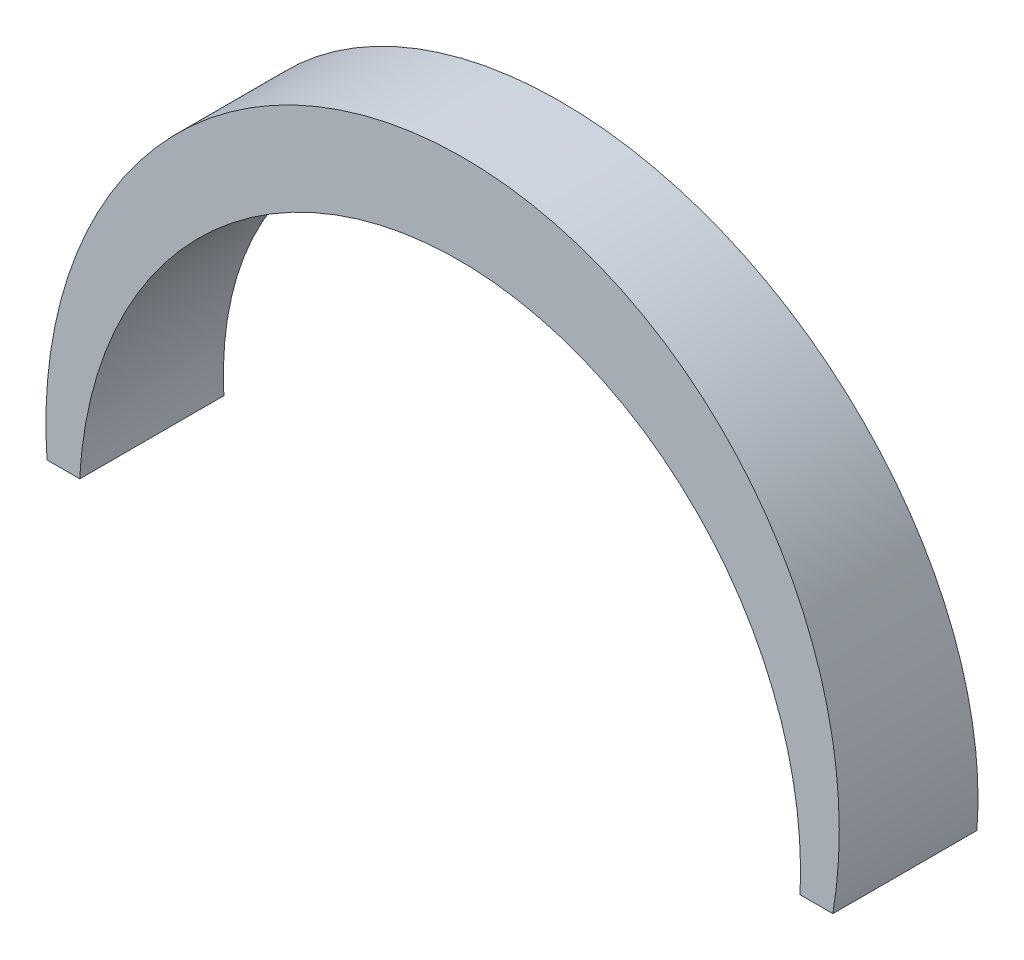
from build123d import *

# Parameters (mm, degrees)
LINEAR_AUSTRAGEN1_DEPTH         = 10
SCHNITT_LINEAR_AUSTRAGEN1_DEPTH = 84.480536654


with BuildPart() as part:
    # Skizze1 → Linear austragen1 (new body)
    with BuildSketch(Plane.XY):
        with BuildLine():
            Line((-54.552726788, 0), (-50, 0))
            ThreePointArc((-50, 0), (0, 50), (50, 0))
            Line((50, 0), (54.552726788, 0))
            ThreePointArc((54.552726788, 0), (0, 62), (-54.552726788, 0))
        make_face()
    linear_austragen1 = extrude(amount=LINEAR_AUSTRAGEN1_DEPTH)

    # Skizze2 → Schnitt-Linear austragen1 (cut, symmetric)
    with BuildSketch(Plane(origin=(0, 0, 0), x_dir=(0, 0, -1), z_dir=(1, 0, 0))):
        Polygon((-18.15703339, -155.645469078), (-10, 0), (-6.191724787, 72.666219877), (1.965308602, 228.311688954), (-309.325629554, 244.625755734), (-329.447971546, -139.331402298), align=None)
    schnitt_linear_austragen1 = extrude(amount=SCHNITT_LINEAR_AUSTRAGEN1_DEPTH, both=True, mode=Mode.SUBTRACT)

    # Spiegeln1: Linear austragen1, Schnitt-Linear austragen1 across plane
    add(linear_austragen1.mirror(Plane.XY))
    add(schnitt_linear_austragen1.mirror(Plane.XY), mode=Mode.SUBTRACT)


solid = part.part
